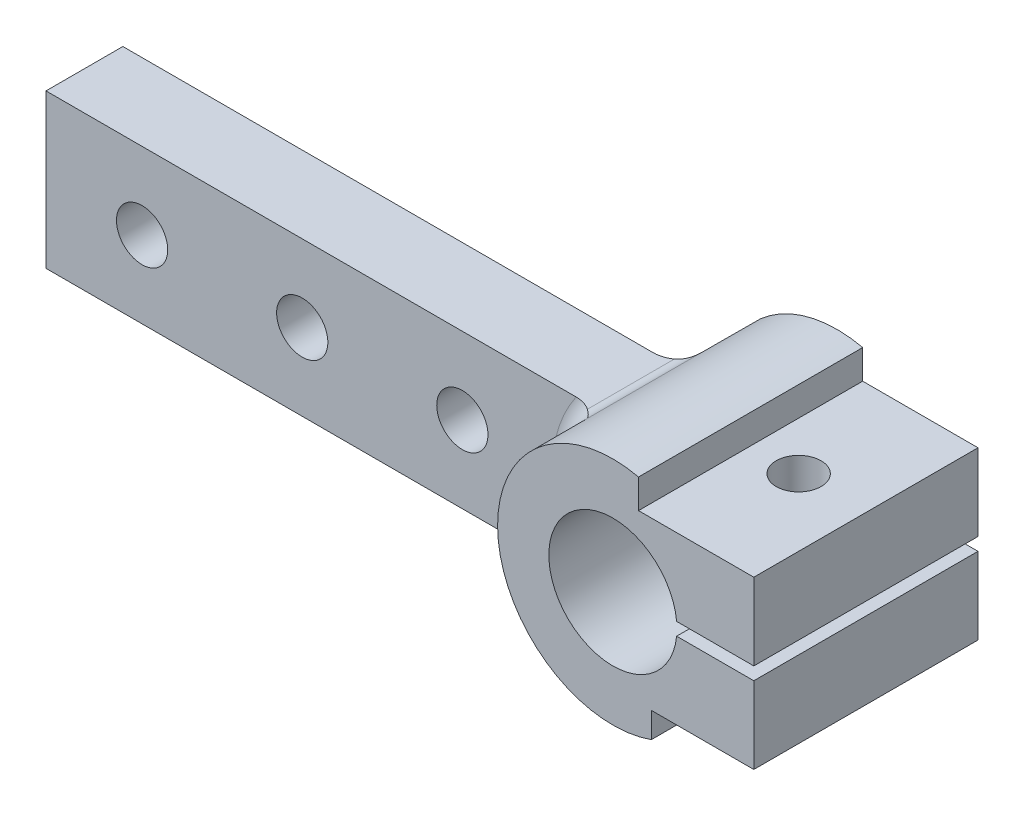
ISO-10303-21;
HEADER;
FILE_DESCRIPTION(('STEP AP214'),'2;1');
FILE_NAME('part.step','',(''),(''),'','','');
FILE_SCHEMA(('AUTOMOTIVE_DESIGN { 1 0 10303 214 1 1 1 1 }'));
ENDSEC;
DATA;
#1=APPLICATION_CONTEXT('core data for automotive mechanical design processes');
#2=APPLICATION_PROTOCOL_DEFINITION('international standard','automotive_design',2000,#1);
#3=PRODUCT_CONTEXT('',#1,'mechanical');
#4=PRODUCT('Part','Part','',(#3));
#5=PRODUCT_RELATED_PRODUCT_CATEGORY('part','',(#4));
#6=PRODUCT_DEFINITION_FORMATION('','',#4);
#7=PRODUCT_DEFINITION_CONTEXT('part definition',#1,'design');
#8=PRODUCT_DEFINITION('design','',#6,#7);
#9=PRODUCT_DEFINITION_SHAPE('','',#8);
#10=(LENGTH_UNIT() NAMED_UNIT(*) SI_UNIT(.MILLI.,.METRE.));
#11=(NAMED_UNIT(*) PLANE_ANGLE_UNIT() SI_UNIT($,.RADIAN.));
#12=(NAMED_UNIT(*) SI_UNIT($,.STERADIAN.) SOLID_ANGLE_UNIT());
#13=UNCERTAINTY_MEASURE_WITH_UNIT(LENGTH_MEASURE(1.E-05),#10,'distance_accuracy_value','');
#14=(GEOMETRIC_REPRESENTATION_CONTEXT(3) GLOBAL_UNCERTAINTY_ASSIGNED_CONTEXT((#13)) GLOBAL_UNIT_ASSIGNED_CONTEXT((#10,
#11,#12)) REPRESENTATION_CONTEXT('',''));
#15=CARTESIAN_POINT('',(0.,0.,0.));
#16=DIRECTION('',(0.,0.,1.));
#17=DIRECTION('',(1.,0.,0.));
#18=AXIS2_PLACEMENT_3D('',#15,#16,#17);
#19=CARTESIAN_POINT('',(22.,14.,17.5));
#20=DIRECTION('',(-1.,0.,0.));
#21=DIRECTION('',(0.,0.,1.));
#22=AXIS2_PLACEMENT_3D('',#19,#20,#21);
#23=PLANE('',#22);
#24=DIRECTION('',(0.,1.,0.));
#25=VECTOR('',#24,1.);
#26=CARTESIAN_POINT('',(22.,14.,17.5));
#27=LINE('',#26,#25);
#28=CARTESIAN_POINT('',(22.,0.999999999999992,17.5));
#29=VERTEX_POINT('',#28);
#30=CARTESIAN_POINT('',(22.,13.,17.5));
#31=VERTEX_POINT('',#30);
#32=EDGE_CURVE('E196',#29,#31,#27,.T.);
#33=ORIENTED_EDGE('',*,*,#32,.F.);
#34=DIRECTION('',(0.,0.,-1.));
#35=VECTOR('',#34,1.);
#36=CARTESIAN_POINT('',(22.,0.999999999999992,17.5));
#37=LINE('',#36,#35);
#38=CARTESIAN_POINT('',(22.,0.999999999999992,-17.5));
#39=VERTEX_POINT('',#38);
#40=EDGE_CURVE('E177',#29,#39,#37,.T.);
#41=ORIENTED_EDGE('',*,*,#40,.T.);
#42=DIRECTION('',(0.,1.,0.));
#43=VECTOR('',#42,1.);
#44=CARTESIAN_POINT('',(22.,14.,-17.5));
#45=LINE('',#44,#43);
#46=CARTESIAN_POINT('',(22.,13.,-17.5));
#47=VERTEX_POINT('',#46);
#48=EDGE_CURVE('E197',#39,#47,#45,.T.);
#49=ORIENTED_EDGE('',*,*,#48,.T.);
#50=DIRECTION('',(0.,0.,-1.));
#51=VECTOR('',#50,1.);
#52=CARTESIAN_POINT('',(22.,13.,17.5));
#53=LINE('',#52,#51);
#54=EDGE_CURVE('E342',#31,#47,#53,.T.);
#55=ORIENTED_EDGE('',*,*,#54,.F.);
#56=EDGE_LOOP('',(#33,#41,#49,#55));
#57=FACE_BOUND('',#56,.T.);
#58=ADVANCED_FACE('F30',(#57),#23,.F.);
#59=CARTESIAN_POINT('',(11.5,-18.,0.));
#60=DIRECTION('',(0.,1.,0.));
#61=DIRECTION('',(0.,0.,1.));
#62=AXIS2_PLACEMENT_3D('',#59,#60,#61);
#63=CYLINDRICAL_SURFACE('',#62,3.5);
#64=CARTESIAN_POINT('',(11.5,13.,0.));
#65=DIRECTION('',(0.,-1.,0.));
#66=DIRECTION('',(0.,0.,-1.));
#67=AXIS2_PLACEMENT_3D('',#64,#65,#66);
#68=CIRCLE('',#67,3.5);
#69=CARTESIAN_POINT('',(11.5,13.,-3.5));
#70=VERTEX_POINT('',#69);
#71=EDGE_CURVE('E221',#70,#70,#68,.F.);
#72=ORIENTED_EDGE('',*,*,#71,.T.);
#73=EDGE_LOOP('',(#72));
#74=FACE_BOUND('',#73,.T.);
#75=CARTESIAN_POINT('',(8.,-6.,0.));
#76=CARTESIAN_POINT('',(8.00000040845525,-5.99999966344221,0.0670353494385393));
#77=CARTESIAN_POINT('',(8.00193129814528,-5.99742758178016,0.134096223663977));
#78=CARTESIAN_POINT('',(8.00960622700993,-5.98717362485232,0.26764031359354));
#79=CARTESIAN_POINT('',(8.01535312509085,-5.9794879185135,0.334123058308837));
#80=CARTESIAN_POINT('',(8.03053092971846,-5.95908841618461,0.466046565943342));
#81=CARTESIAN_POINT('',(8.0399701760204,-5.94636323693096,0.531484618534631));
#82=CARTESIAN_POINT('',(8.06228834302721,-5.91606782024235,0.660640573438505));
#83=CARTESIAN_POINT('',(8.07516895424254,-5.89849520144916,0.72435761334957));
#84=CARTESIAN_POINT('',(8.11832200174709,-5.8391130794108,0.911302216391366));
#85=CARTESIAN_POINT('',(8.15323440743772,-5.79047169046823,1.0313783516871));
#86=CARTESIAN_POINT('',(8.23245744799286,-5.67727012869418,1.260111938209));
#87=CARTESIAN_POINT('',(8.27676667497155,-5.61271234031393,1.36877109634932));
#88=CARTESIAN_POINT('',(8.38709910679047,-5.44695787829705,1.60691939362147));
#89=CARTESIAN_POINT('',(8.4555062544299,-5.34066720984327,1.73175098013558));
#90=CARTESIAN_POINT('',(8.59705502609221,-5.10969899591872,1.95985748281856));
#91=CARTESIAN_POINT('',(8.67020537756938,-4.98498698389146,2.06309109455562));
#92=CARTESIAN_POINT('',(8.79705902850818,-4.75648089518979,2.22524501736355));
#93=CARTESIAN_POINT('',(8.85080853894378,-4.65583185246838,2.2886746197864));
#94=CARTESIAN_POINT('',(8.95687980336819,-4.44835596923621,2.40599253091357));
#95=CARTESIAN_POINT('',(9.0092008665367,-4.34152621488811,2.45987628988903));
#96=CARTESIAN_POINT('',(9.11141414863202,-4.12271099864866,2.55924735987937));
#97=CARTESIAN_POINT('',(9.16130234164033,-4.0107175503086,2.60472107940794));
#98=CARTESIAN_POINT('',(9.25781641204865,-3.78261706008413,2.68824850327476));
#99=CARTESIAN_POINT('',(9.30444120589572,-3.6665086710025,2.72629975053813));
#100=CARTESIAN_POINT('',(9.41940438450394,-3.36362254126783,2.81586397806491));
#101=CARTESIAN_POINT('',(9.48492984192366,-3.17436793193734,2.862648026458));
#102=CARTESIAN_POINT('',(9.60509450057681,-2.78977246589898,2.94356333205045));
#103=CARTESIAN_POINT('',(9.65972756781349,-2.59442825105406,2.97768746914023));
#104=CARTESIAN_POINT('',(9.75730686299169,-2.19918979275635,3.03582712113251));
#105=CARTESIAN_POINT('',(9.80024193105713,-1.99929140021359,3.0598329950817));
#106=CARTESIAN_POINT('',(9.87386007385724,-1.5964992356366,3.09958276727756));
#107=CARTESIAN_POINT('',(9.90454516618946,-1.39360596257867,3.11532802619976));
#108=CARTESIAN_POINT('',(9.95455471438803,-0.976256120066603,3.14044917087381));
#109=CARTESIAN_POINT('',(9.97327270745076,-0.761706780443,3.14948830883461));
#110=CARTESIAN_POINT('',(9.99681882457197,-0.33165693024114,3.16079335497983));
#111=CARTESIAN_POINT('',(10.0016456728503,-0.116156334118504,3.16305864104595));
#112=CARTESIAN_POINT('',(9.99736887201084,0.314694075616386,3.16102914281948));
#113=CARTESIAN_POINT('',(9.98826406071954,0.530043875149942,3.15673381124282));
#114=CARTESIAN_POINT('',(9.9561945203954,0.959443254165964,3.14117589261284));
#115=CARTESIAN_POINT('',(9.93323132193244,1.17349297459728,3.12991407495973));
#116=CARTESIAN_POINT('',(9.87598441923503,1.58245582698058,3.10056773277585));
#117=CARTESIAN_POINT('',(9.84272703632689,1.7775558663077,3.08308597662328));
#118=CARTESIAN_POINT('',(9.76490281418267,2.16463282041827,3.03997083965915));
#119=CARTESIAN_POINT('',(9.720334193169,2.35660923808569,3.01433617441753));
#120=CARTESIAN_POINT('',(9.62048325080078,2.7358146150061,2.95310741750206));
#121=CARTESIAN_POINT('',(9.56521872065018,2.92305088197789,2.91752982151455));
#122=CARTESIAN_POINT('',(9.44477909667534,3.2914469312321,2.83398150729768));
#123=CARTESIAN_POINT('',(9.37960995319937,3.4726102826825,2.78601821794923));
#124=CARTESIAN_POINT('',(9.26948946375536,3.75353804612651,2.69768909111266));
#125=CARTESIAN_POINT('',(9.22731510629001,3.85599682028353,2.66237713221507));
#126=CARTESIAN_POINT('',(9.14048017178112,4.05754199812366,2.58573485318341));
#127=CARTESIAN_POINT('',(9.09582027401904,4.15662931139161,2.54440617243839));
#128=CARTESIAN_POINT('',(9.00459513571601,4.3507182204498,2.45500087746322));
#129=CARTESIAN_POINT('',(8.95803143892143,4.44572300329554,2.40692965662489));
#130=CARTESIAN_POINT('',(8.86373041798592,4.63088452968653,2.30325608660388));
#131=CARTESIAN_POINT('',(8.81599340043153,4.72104252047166,2.24765568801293));
#132=CARTESIAN_POINT('',(8.69524511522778,4.94121163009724,2.09689431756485));
#133=CARTESIAN_POINT('',(8.62204770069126,5.06746071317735,1.99623252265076));
#134=CARTESIAN_POINT('',(8.47972871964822,5.30217010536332,1.77351001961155));
#135=CARTESIAN_POINT('',(8.41060108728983,5.41065734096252,1.65148229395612));
#136=CARTESIAN_POINT('',(8.2967789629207,5.58316268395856,1.41511365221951));
#137=CARTESIAN_POINT('',(8.25006597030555,5.65170697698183,1.30507113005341));
#138=CARTESIAN_POINT('',(8.16619675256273,5.77222921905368,1.07282783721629));
#139=CARTESIAN_POINT('',(8.12903635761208,5.82421439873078,0.950632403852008));
#140=CARTESIAN_POINT('',(8.06731930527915,5.90941521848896,0.69570422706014));
#141=CARTESIAN_POINT('',(8.04285676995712,5.94249087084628,0.562900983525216));
#142=CARTESIAN_POINT('',(8.0095235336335,5.98734930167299,0.291839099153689));
#143=CARTESIAN_POINT('',(8.00064327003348,5.9991451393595,0.153583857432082));
#144=CARTESIAN_POINT('',(7.99949663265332,6.00066866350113,-0.10642656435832));
#145=CARTESIAN_POINT('',(8.00536277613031,5.99287691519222,-0.228168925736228));
#146=CARTESIAN_POINT('',(8.02935737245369,5.96068948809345,-0.468161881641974));
#147=CARTESIAN_POINT('',(8.04748400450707,5.93629627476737,-0.586412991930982));
#148=CARTESIAN_POINT('',(8.09418334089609,5.87245371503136,-0.81475623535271));
#149=CARTESIAN_POINT('',(8.12261175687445,5.83321201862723,-0.924936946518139));
#150=CARTESIAN_POINT('',(8.18789409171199,5.74121664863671,-1.13677787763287));
#151=CARTESIAN_POINT('',(8.22475115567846,5.68845793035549,-1.2384348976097));
#152=CARTESIAN_POINT('',(8.32019589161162,5.54833215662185,-1.46969053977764));
#153=CARTESIAN_POINT('',(8.38166053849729,5.45548501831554,-1.59478309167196));
#154=CARTESIAN_POINT('',(8.51083986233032,5.25168221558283,-1.82551645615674));
#155=CARTESIAN_POINT('',(8.57856645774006,5.14069169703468,-1.93111897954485));
#156=CARTESIAN_POINT('',(8.69622003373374,4.93815684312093,-2.09666608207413));
#157=CARTESIAN_POINT('',(8.74577558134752,4.84996574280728,-2.16108483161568));
#158=CARTESIAN_POINT('',(8.84445361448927,4.66758839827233,-2.28125462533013));
#159=CARTESIAN_POINT('',(8.89357590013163,4.57339953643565,-2.33700184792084));
#160=CARTESIAN_POINT('',(8.99041049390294,4.37998142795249,-2.44069684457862));
#161=CARTESIAN_POINT('',(9.03812089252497,4.28074580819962,-2.48863441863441));
#162=CARTESIAN_POINT('',(9.13132181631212,4.07816271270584,-2.57749983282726));
#163=CARTESIAN_POINT('',(9.17681159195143,3.97481386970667,-2.61842531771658));
#164=CARTESIAN_POINT('',(9.29043254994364,3.70406474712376,-2.71592290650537));
#165=CARTESIAN_POINT('',(9.35647870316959,3.53412248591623,-2.7678933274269));
#166=CARTESIAN_POINT('',(9.48004726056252,3.18787793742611,-2.85931592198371));
#167=CARTESIAN_POINT('',(9.53756487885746,3.0115721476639,-2.89876108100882));
#168=CARTESIAN_POINT('',(9.64321165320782,2.65392092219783,-2.96754372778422));
#169=CARTESIAN_POINT('',(9.69132429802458,2.47256725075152,-2.99686350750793));
#170=CARTESIAN_POINT('',(9.77744918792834,2.10639103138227,-3.04717812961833));
#171=CARTESIAN_POINT('',(9.8154621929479,1.92156874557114,-3.06817359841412));
#172=CARTESIAN_POINT('',(9.89144868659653,1.49035797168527,-3.10885807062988));
#173=CARTESIAN_POINT('',(9.92558098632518,1.24304582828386,-3.12601779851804));
#174=CARTESIAN_POINT('',(9.97526218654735,0.746034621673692,-3.15054391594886));
#175=CARTESIAN_POINT('',(9.99080484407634,0.496334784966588,-3.1579070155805));
#176=CARTESIAN_POINT('',(10.0031270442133,-0.00370140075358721,-3.16376637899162));
#177=CARTESIAN_POINT('',(9.99990114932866,-0.254037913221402,-3.162260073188));
#178=CARTESIAN_POINT('',(9.97470460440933,-0.753496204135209,-3.15018712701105));
#179=CARTESIAN_POINT('',(9.95273931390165,-1.00261830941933,-3.13962307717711));
#180=CARTESIAN_POINT('',(9.89608469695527,-1.4522321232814,-3.11098818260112));
#181=CARTESIAN_POINT('',(9.86448439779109,-1.65322895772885,-3.09465851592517));
#182=CARTESIAN_POINT('',(9.78927006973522,-2.05216377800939,-3.05372670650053));
#183=CARTESIAN_POINT('',(9.74565471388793,-2.2501014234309,-3.0291236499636));
#184=CARTESIAN_POINT('',(9.6470240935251,-2.64111609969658,-2.96981240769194));
#185=CARTESIAN_POINT('',(9.5920345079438,-2.83420299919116,-2.93512691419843));
#186=CARTESIAN_POINT('',(9.47144196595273,-3.21425670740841,-2.85311828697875));
#187=CARTESIAN_POINT('',(9.40584543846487,-3.40122714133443,-2.80580279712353));
#188=CARTESIAN_POINT('',(9.29511243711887,-3.68967886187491,-2.71866003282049));
#189=CARTESIAN_POINT('',(9.25302365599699,-3.79393982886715,-2.68409899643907));
#190=CARTESIAN_POINT('',(9.16620641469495,-3.99913168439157,-2.60896692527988));
#191=CARTESIAN_POINT('',(9.1214786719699,-4.10006346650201,-2.56839751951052));
#192=CARTESIAN_POINT('',(9.02994606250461,-4.2978993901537,-2.48049522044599));
#193=CARTESIAN_POINT('',(8.98314255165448,-4.3948060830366,-2.43316669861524));
#194=CARTESIAN_POINT('',(8.88818544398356,-4.58381495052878,-2.33094113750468));
#195=CARTESIAN_POINT('',(8.8400321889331,-4.67591832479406,-2.27604600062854));
#196=CARTESIAN_POINT('',(8.71771009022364,-4.90158053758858,-2.12662133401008));
#197=CARTESIAN_POINT('',(8.64322827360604,-5.03135338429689,-2.02646791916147));
#198=CARTESIAN_POINT('',(8.49795887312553,-5.27300022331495,-1.80423857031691));
#199=CARTESIAN_POINT('',(8.42716555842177,-5.38490257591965,-1.68219803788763));
#200=CARTESIAN_POINT('',(8.31058608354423,-5.56262572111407,-1.44596350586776));
#201=CARTESIAN_POINT('',(8.2627773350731,-5.63313670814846,-1.33631756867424));
#202=CARTESIAN_POINT('',(8.17654590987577,-5.75758983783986,-1.10448569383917));
#203=CARTESIAN_POINT('',(8.13811919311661,-5.81153911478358,-0.982305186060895));
#204=CARTESIAN_POINT('',(8.07786802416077,-5.89494608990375,-0.743212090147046));
#205=CARTESIAN_POINT('',(8.05460897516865,-5.92655913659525,-0.627412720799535));
#206=CARTESIAN_POINT('',(8.01987098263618,-5.97348682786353,-0.391003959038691));
#207=CARTESIAN_POINT('',(8.00836088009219,-5.98884458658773,-0.270408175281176));
#208=CARTESIAN_POINT('',(8.00212267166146,-5.99716849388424,-0.124420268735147));
#209=CARTESIAN_POINT('',(8.00132751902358,-5.99822952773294,-0.0995587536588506));
#210=CARTESIAN_POINT('',(8.00026607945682,-5.99964538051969,-0.049799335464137));
#211=CARTESIAN_POINT('',(7.9999998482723,-6.00000012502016,-0.0249014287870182));
#212=CARTESIAN_POINT('',(8.,-6.,0.));
#213=B_SPLINE_CURVE_WITH_KNOTS('',3,(#75,#76,#77,#78,#79,#80,#81,#82,#83,#84,#85,#86,#87,#88,
#89,#90,#91,#92,#93,#94,#95,#96,#97,#98,#99,#100,#101,#102,#103,#104,#105,#106,#107,#108,#109,
#110,#111,#112,#113,#114,#115,#116,#117,#118,#119,#120,#121,#122,#123,#124,#125,#126,#127,#128,
#129,#130,#131,#132,#133,#134,#135,#136,#137,#138,#139,#140,#141,#142,#143,#144,#145,#146,#147,
#148,#149,#150,#151,#152,#153,#154,#155,#156,#157,#158,#159,#160,#161,#162,#163,#164,#165,#166,
#167,#168,#169,#170,#171,#172,#173,#174,#175,#176,#177,#178,#179,#180,#181,#182,#183,#184,#185,
#186,#187,#188,#189,#190,#191,#192,#193,#194,#195,#196,#197,#198,#199,#200,#201,#202,#203,#204,
#205,#206,#207,#208,#209,#210,#211,#212),.UNSPECIFIED.,.T.,.F.,(4,2,2,2,2,2,2,2,2,2,2,2,2,2,2,2,
2,2,2,2,2,2,2,2,2,2,2,2,2,2,2,2,2,2,2,2,2,2,2,2,2,2,2,2,2,2,2,2,2,2,2,2,2,2,2,2,2,2,2,2,2,2,2,2,
2,2,2,2,4),(0.,0.201073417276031,0.402297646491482,0.603979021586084,0.805759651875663,
1.20613950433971,1.60645941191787,2.13648186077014,2.66750885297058,3.05863542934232,
3.44994792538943,3.84188739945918,4.23395639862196,4.85001851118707,5.46642658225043,
6.08342066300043,6.70031308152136,7.34640411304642,7.99255448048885,8.6387587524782,
9.28489166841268,9.88046959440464,10.476141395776,11.0708307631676,11.6651642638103,
12.0138418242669,12.3624245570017,12.7107300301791,13.0589454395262,13.5889213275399,
14.1180861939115,14.5298806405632,14.9414950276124,15.3561184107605,15.7704872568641,
16.1350834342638,16.4996254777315,16.8592474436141,17.2190038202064,17.7186527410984,
18.2192730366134,18.5785949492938,18.9380747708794,19.2980204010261,19.6580866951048,
20.2259625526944,20.7941558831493,21.3633379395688,21.9324771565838,22.6822402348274,
23.4322550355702,24.182487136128,24.9325047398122,25.5443696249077,26.1563021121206,
26.7668678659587,27.3770649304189,27.7297563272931,28.0823522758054,28.4347212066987,
28.7870017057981,29.3252707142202,29.8626768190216,30.2776339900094,30.692412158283,
31.0576595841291,31.4219358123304,31.4966201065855,31.5713122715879),.UNSPECIFIED.);
#214=CARTESIAN_POINT('',(9.9498743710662,1.,3.13801060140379));
#215=VERTEX_POINT('',#214);
#216=CARTESIAN_POINT('',(9.9498743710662,0.999999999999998,-3.13801060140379));
#217=VERTEX_POINT('',#216);
#218=EDGE_CURVE('E219',#215,#217,#213,.T.);
#219=ORIENTED_EDGE('',*,*,#218,.T.);
#220=CARTESIAN_POINT('',(11.5,0.999999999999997,0.));
#221=DIRECTION('',(0.,1.,0.));
#222=DIRECTION('',(-1.,0.,0.));
#223=AXIS2_PLACEMENT_3D('',#220,#221,#222);
#224=CIRCLE('',#223,3.5);
#225=EDGE_CURVE('E310',#217,#215,#224,.F.);
#226=ORIENTED_EDGE('',*,*,#225,.T.);
#227=EDGE_LOOP('',(#219,#226));
#228=FACE_BOUND('',#227,.T.);
#229=ADVANCED_FACE('F422',(#74,#228),#63,.F.);
#230=CARTESIAN_POINT('',(0.,0.,17.5));
#231=DIRECTION('',(0.,0.,-1.));
#232=DIRECTION('',(-1.,0.,0.));
#233=AXIS2_PLACEMENT_3D('',#230,#231,#232);
#234=CYLINDRICAL_SURFACE('',#233,18.);
#235=CARTESIAN_POINT('',(0.,0.,9.));
#236=DIRECTION('',(0.,0.,-1.));
#237=DIRECTION('',(-1.,0.,0.));
#238=AXIS2_PLACEMENT_3D('',#235,#236,#237);
#239=CIRCLE('',#238,18.);
#240=CARTESIAN_POINT('',(-12.5973758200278,12.8571428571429,9.));
#241=VERTEX_POINT('',#240);
#242=CARTESIAN_POINT('',(-12.5973758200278,-12.8571428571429,9.));
#243=VERTEX_POINT('',#242);
#244=EDGE_CURVE('E480',#241,#243,#239,.F.);
#245=ORIENTED_EDGE('',*,*,#244,.T.);
#246=DIRECTION('',(0.,0.,-1.));
#247=VECTOR('',#246,1.);
#248=CARTESIAN_POINT('',(-12.5973758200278,-12.8571428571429,17.5));
#249=LINE('',#248,#247);
#250=CARTESIAN_POINT('',(-12.5973758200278,-12.8571428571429,-9.));
#251=VERTEX_POINT('',#250);
#252=EDGE_CURVE('E482',#243,#251,#249,.T.);
#253=ORIENTED_EDGE('',*,*,#252,.T.);
#254=CARTESIAN_POINT('',(0.,0.,-9.));
#255=DIRECTION('',(0.,0.,-1.));
#256=DIRECTION('',(-1.,0.,0.));
#257=AXIS2_PLACEMENT_3D('',#254,#255,#256);
#258=CIRCLE('',#257,18.);
#259=CARTESIAN_POINT('',(-12.5973758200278,12.8571428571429,-9.));
#260=VERTEX_POINT('',#259);
#261=EDGE_CURVE('E385',#251,#260,#258,.T.);
#262=ORIENTED_EDGE('',*,*,#261,.T.);
#263=DIRECTION('',(0.,0.,-1.));
#264=VECTOR('',#263,1.);
#265=CARTESIAN_POINT('',(-12.5973758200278,12.8571428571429,17.5));
#266=LINE('',#265,#264);
#267=EDGE_CURVE('E478',#260,#241,#266,.F.);
#268=ORIENTED_EDGE('',*,*,#267,.T.);
#269=EDGE_LOOP('',(#245,#253,#262,#268));
#270=FACE_BOUND('',#269,.T.);
#271=CARTESIAN_POINT('',(0.,0.,-17.5));
#272=DIRECTION('',(0.,0.,1.));
#273=DIRECTION('',(1.,0.,0.));
#274=AXIS2_PLACEMENT_3D('',#271,#272,#273);
#275=CIRCLE('',#274,18.);
#276=CARTESIAN_POINT('',(4.,17.5499287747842,-17.5));
#277=VERTEX_POINT('',#276);
#278=CARTESIAN_POINT('',(5.99999999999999,-16.9705627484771,-17.5));
#279=VERTEX_POINT('',#278);
#280=EDGE_CURVE('E205',#277,#279,#275,.T.);
#281=ORIENTED_EDGE('',*,*,#280,.T.);
#282=DIRECTION('',(0.,0.,-1.));
#283=VECTOR('',#282,1.);
#284=CARTESIAN_POINT('',(6.,-16.9705627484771,17.5));
#285=LINE('',#284,#283);
#286=CARTESIAN_POINT('',(5.99999999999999,-16.9705627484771,17.5));
#287=VERTEX_POINT('',#286);
#288=EDGE_CURVE('E328',#279,#287,#285,.F.);
#289=ORIENTED_EDGE('',*,*,#288,.T.);
#290=CARTESIAN_POINT('',(0.,0.,17.5));
#291=DIRECTION('',(0.,0.,1.));
#292=DIRECTION('',(1.,0.,0.));
#293=AXIS2_PLACEMENT_3D('',#290,#291,#292);
#294=CIRCLE('',#293,18.);
#295=CARTESIAN_POINT('',(4.,17.5499287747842,17.5));
#296=VERTEX_POINT('',#295);
#297=EDGE_CURVE('E208',#296,#287,#294,.T.);
#298=ORIENTED_EDGE('',*,*,#297,.F.);
#299=DIRECTION('',(0.,0.,-1.));
#300=VECTOR('',#299,1.);
#301=CARTESIAN_POINT('',(4.,17.5499287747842,17.5));
#302=LINE('',#301,#300);
#303=EDGE_CURVE('E347',#296,#277,#302,.T.);
#304=ORIENTED_EDGE('',*,*,#303,.T.);
#305=EDGE_LOOP('',(#281,#289,#298,#304));
#306=FACE_BOUND('',#305,.T.);
#307=ADVANCED_FACE('F32',(#270,#306),#234,.T.);
#308=CARTESIAN_POINT('',(0.,0.,17.5));
#309=DIRECTION('',(0.,0.,1.));
#310=DIRECTION('',(1.,0.,0.));
#311=AXIS2_PLACEMENT_3D('',#308,#309,#310);
#312=PLANE('',#311);
#313=DIRECTION('',(1.,0.,0.));
#314=VECTOR('',#313,1.);
#315=CARTESIAN_POINT('',(22.,0.999999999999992,17.5));
#316=LINE('',#315,#314);
#317=CARTESIAN_POINT('',(9.9498743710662,1.,17.5));
#318=VERTEX_POINT('',#317);
#319=EDGE_CURVE('E178',#318,#29,#316,.T.);
#320=ORIENTED_EDGE('',*,*,#319,.T.);
#321=ORIENTED_EDGE('',*,*,#32,.T.);
#322=DIRECTION('',(-1.,0.,0.));
#323=VECTOR('',#322,1.);
#324=CARTESIAN_POINT('',(22.,13.,17.5));
#325=LINE('',#324,#323);
#326=CARTESIAN_POINT('',(4.,13.,17.5));
#327=VERTEX_POINT('',#326);
#328=EDGE_CURVE('E336',#31,#327,#325,.T.);
#329=ORIENTED_EDGE('',*,*,#328,.T.);
#330=DIRECTION('',(0.,1.,0.));
#331=VECTOR('',#330,1.);
#332=CARTESIAN_POINT('',(4.,13.,17.5));
#333=LINE('',#332,#331);
#334=EDGE_CURVE('E339',#327,#296,#333,.T.);
#335=ORIENTED_EDGE('',*,*,#334,.T.);
#336=ORIENTED_EDGE('',*,*,#297,.T.);
#337=DIRECTION('',(0.,1.,0.));
#338=VECTOR('',#337,1.);
#339=CARTESIAN_POINT('',(6.,-13.,17.5));
#340=LINE('',#339,#338);
#341=CARTESIAN_POINT('',(6.,-13.,17.5));
#342=VERTEX_POINT('',#341);
#343=EDGE_CURVE('E317',#287,#342,#340,.T.);
#344=ORIENTED_EDGE('',*,*,#343,.T.);
#345=DIRECTION('',(1.,0.,0.));
#346=VECTOR('',#345,1.);
#347=CARTESIAN_POINT('',(22.,-13.,17.5));
#348=LINE('',#347,#346);
#349=CARTESIAN_POINT('',(22.,-13.,17.5));
#350=VERTEX_POINT('',#349);
#351=EDGE_CURVE('E320',#342,#350,#348,.T.);
#352=ORIENTED_EDGE('',*,*,#351,.T.);
#353=CARTESIAN_POINT('',(22.,-1.00000000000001,17.5));
#354=VERTEX_POINT('',#353);
#355=EDGE_CURVE('E199',#350,#354,#27,.T.);
#356=ORIENTED_EDGE('',*,*,#355,.T.);
#357=DIRECTION('',(-1.,0.,0.));
#358=VECTOR('',#357,1.);
#359=CARTESIAN_POINT('',(22.,-1.00000000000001,17.5));
#360=LINE('',#359,#358);
#361=CARTESIAN_POINT('',(9.9498743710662,-1.00000000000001,17.5));
#362=VERTEX_POINT('',#361);
#363=EDGE_CURVE('E172',#354,#362,#360,.T.);
#364=ORIENTED_EDGE('',*,*,#363,.T.);
#365=CARTESIAN_POINT('',(0.,0.,17.5));
#366=DIRECTION('',(0.,0.,-1.));
#367=DIRECTION('',(-1.,0.,0.));
#368=AXIS2_PLACEMENT_3D('',#365,#366,#367);
#369=CIRCLE('',#368,10.);
#370=EDGE_CURVE('E220',#362,#318,#369,.T.);
#371=ORIENTED_EDGE('',*,*,#370,.T.);
#372=EDGE_LOOP('',(#320,#321,#329,#335,#336,#344,#352,#356,#364,#371));
#373=FACE_BOUND('',#372,.T.);
#374=ADVANCED_FACE('F435',(#373),#312,.T.);
#375=CARTESIAN_POINT('',(0.,0.,-17.5));
#376=DIRECTION('',(0.,0.,1.));
#377=DIRECTION('',(1.,0.,0.));
#378=AXIS2_PLACEMENT_3D('',#375,#376,#377);
#379=PLANE('',#378);
#380=ORIENTED_EDGE('',*,*,#48,.F.);
#381=DIRECTION('',(1.,0.,0.));
#382=VECTOR('',#381,1.);
#383=CARTESIAN_POINT('',(22.,0.999999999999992,-17.5));
#384=LINE('',#383,#382);
#385=CARTESIAN_POINT('',(9.9498743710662,1.,-17.5));
#386=VERTEX_POINT('',#385);
#387=EDGE_CURVE('E190',#386,#39,#384,.T.);
#388=ORIENTED_EDGE('',*,*,#387,.F.);
#389=CARTESIAN_POINT('',(0.,0.,-17.5));
#390=DIRECTION('',(0.,0.,-1.));
#391=DIRECTION('',(-1.,0.,0.));
#392=AXIS2_PLACEMENT_3D('',#389,#390,#391);
#393=CIRCLE('',#392,10.);
#394=CARTESIAN_POINT('',(9.9498743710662,-1.00000000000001,-17.5));
#395=VERTEX_POINT('',#394);
#396=EDGE_CURVE('E189',#395,#386,#393,.T.);
#397=ORIENTED_EDGE('',*,*,#396,.F.);
#398=DIRECTION('',(-1.,0.,0.));
#399=VECTOR('',#398,1.);
#400=CARTESIAN_POINT('',(22.,-1.00000000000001,-17.5));
#401=LINE('',#400,#399);
#402=CARTESIAN_POINT('',(22.,-1.00000000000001,-17.5));
#403=VERTEX_POINT('',#402);
#404=EDGE_CURVE('E169',#403,#395,#401,.T.);
#405=ORIENTED_EDGE('',*,*,#404,.F.);
#406=CARTESIAN_POINT('',(22.,-13.,-17.5));
#407=VERTEX_POINT('',#406);
#408=EDGE_CURVE('E186',#407,#403,#45,.T.);
#409=ORIENTED_EDGE('',*,*,#408,.F.);
#410=DIRECTION('',(1.,0.,0.));
#411=VECTOR('',#410,1.);
#412=CARTESIAN_POINT('',(22.,-13.,-17.5));
#413=LINE('',#412,#411);
#414=CARTESIAN_POINT('',(6.,-13.,-17.5));
#415=VERTEX_POINT('',#414);
#416=EDGE_CURVE('E315',#415,#407,#413,.T.);
#417=ORIENTED_EDGE('',*,*,#416,.F.);
#418=DIRECTION('',(0.,1.,0.));
#419=VECTOR('',#418,1.);
#420=CARTESIAN_POINT('',(6.,-13.,-17.5));
#421=LINE('',#420,#419);
#422=EDGE_CURVE('E313',#279,#415,#421,.T.);
#423=ORIENTED_EDGE('',*,*,#422,.F.);
#424=ORIENTED_EDGE('',*,*,#280,.F.);
#425=DIRECTION('',(0.,1.,0.));
#426=VECTOR('',#425,1.);
#427=CARTESIAN_POINT('',(4.,13.,-17.5));
#428=LINE('',#427,#426);
#429=CARTESIAN_POINT('',(4.,13.,-17.5));
#430=VERTEX_POINT('',#429);
#431=EDGE_CURVE('E334',#430,#277,#428,.T.);
#432=ORIENTED_EDGE('',*,*,#431,.F.);
#433=DIRECTION('',(-1.,0.,0.));
#434=VECTOR('',#433,1.);
#435=CARTESIAN_POINT('',(22.,13.,-17.5));
#436=LINE('',#435,#434);
#437=EDGE_CURVE('E331',#47,#430,#436,.T.);
#438=ORIENTED_EDGE('',*,*,#437,.F.);
#439=EDGE_LOOP('',(#380,#388,#397,#405,#409,#417,#423,#424,#432,#438));
#440=FACE_BOUND('',#439,.T.);
#441=ADVANCED_FACE('F184',(#440),#379,.F.);
#442=ORIENTED_EDGE('',*,*,#408,.T.);
#443=DIRECTION('',(0.,0.,-1.));
#444=VECTOR('',#443,1.);
#445=CARTESIAN_POINT('',(22.,-1.00000000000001,17.5));
#446=LINE('',#445,#444);
#447=EDGE_CURVE('E166',#354,#403,#446,.T.);
#448=ORIENTED_EDGE('',*,*,#447,.F.);
#449=ORIENTED_EDGE('',*,*,#355,.F.);
#450=DIRECTION('',(0.,0.,-1.));
#451=VECTOR('',#450,1.);
#452=CARTESIAN_POINT('',(22.,-13.,17.5));
#453=LINE('',#452,#451);
#454=EDGE_CURVE('E195',#350,#407,#453,.T.);
#455=ORIENTED_EDGE('',*,*,#454,.T.);
#456=EDGE_LOOP('',(#442,#448,#449,#455));
#457=FACE_BOUND('',#456,.T.);
#458=ADVANCED_FACE('F194',(#457),#23,.F.);
#459=CARTESIAN_POINT('',(11.5,-13.,0.));
#460=DIRECTION('',(0.,1.,0.));
#461=DIRECTION('',(0.,0.,1.));
#462=AXIS2_PLACEMENT_3D('',#459,#460,#461);
#463=CIRCLE('',#462,3.5);
#464=CARTESIAN_POINT('',(11.5,-13.,3.5));
#465=VERTEX_POINT('',#464);
#466=EDGE_CURVE('E325',#465,#465,#463,.F.);
#467=ORIENTED_EDGE('',*,*,#466,.T.);
#468=EDGE_LOOP('',(#467));
#469=FACE_BOUND('',#468,.T.);
#470=CARTESIAN_POINT('',(9.9498743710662,-1.00000000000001,-3.13801060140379));
#471=VERTEX_POINT('',#470);
#472=CARTESIAN_POINT('',(9.9498743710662,-1.,3.13801060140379));
#473=VERTEX_POINT('',#472);
#474=EDGE_CURVE('E212',#471,#473,#213,.T.);
#475=ORIENTED_EDGE('',*,*,#474,.T.);
#476=CARTESIAN_POINT('',(11.5,-1.,0.));
#477=DIRECTION('',(0.,-1.,0.));
#478=DIRECTION('',(0.,0.,-1.));
#479=AXIS2_PLACEMENT_3D('',#476,#477,#478);
#480=CIRCLE('',#479,3.5);
#481=EDGE_CURVE('E306',#473,#471,#480,.F.);
#482=ORIENTED_EDGE('',*,*,#481,.T.);
#483=EDGE_LOOP('',(#475,#482));
#484=FACE_BOUND('',#483,.T.);
#485=ADVANCED_FACE('F223',(#469,#484),#63,.F.);
#486=CARTESIAN_POINT('',(0.,12.,6.));
#487=DIRECTION('',(0.,-1.,0.));
#488=DIRECTION('',(1.,0.,0.));
#489=AXIS2_PLACEMENT_3D('',#486,#487,#488);
#490=PLANE('',#489);
#491=CARTESIAN_POINT('',(-17.2336879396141,12.,6.));
#492=CARTESIAN_POINT('',(-17.1045791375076,12.,6.00001648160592));
#493=CARTESIAN_POINT('',(-16.9755525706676,12.,6.00561384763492));
#494=CARTESIAN_POINT('',(-16.7184281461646,12.,6.02779901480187));
#495=CARTESIAN_POINT('',(-16.5903304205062,12.,6.04438834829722));
#496=CARTESIAN_POINT('',(-16.2153953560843,12.,6.10921533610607));
#497=CARTESIAN_POINT('',(-15.9709706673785,12.,6.17254644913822));
#498=CARTESIAN_POINT('',(-15.5516407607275,12.,6.3198532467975));
#499=CARTESIAN_POINT('',(-15.3737974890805,12.,6.39559140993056));
#500=CARTESIAN_POINT('',(-15.1143189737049,12.,6.52769577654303));
#501=CARTESIAN_POINT('',(-15.0282224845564,12.,6.57538319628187));
#502=CARTESIAN_POINT('',(-14.8596819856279,12.,6.67693578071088));
#503=CARTESIAN_POINT('',(-14.7772403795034,12.,6.73080492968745));
#504=CARTESIAN_POINT('',(-14.6969384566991,12.,6.78776801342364));
#505=B_SPLINE_CURVE_WITH_KNOTS('',3,(#491,#492,#493,#494,#495,#496,#497,#498,#499,#500,#501,
#502,#503,#504),.UNSPECIFIED.,.F.,.F.,(4,2,2,2,2,2,4),(0.,0.387049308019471,0.774152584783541,
1.52777975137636,2.10597480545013,2.40099863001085,2.69621368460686),.UNSPECIFIED.);
#506=CARTESIAN_POINT('',(-17.2336879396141,12.,6.));
#507=VERTEX_POINT('',#506);
#508=CARTESIAN_POINT('',(-14.6969384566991,12.,6.78776801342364));
#509=VERTEX_POINT('',#508);
#510=EDGE_CURVE('E409',#507,#509,#505,.T.);
#511=ORIENTED_EDGE('',*,*,#510,.T.);
#512=DIRECTION('',(0.,0.,1.));
#513=VECTOR('',#512,1.);
#514=CARTESIAN_POINT('',(-14.6969384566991,12.,-6.));
#515=LINE('',#514,#513);
#516=CARTESIAN_POINT('',(-14.6969384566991,12.,-6.78776801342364));
#517=VERTEX_POINT('',#516);
#518=EDGE_CURVE('E47',#509,#517,#515,.F.);
#519=ORIENTED_EDGE('',*,*,#518,.T.);
#520=CARTESIAN_POINT('',(-14.6969384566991,12.,-6.78776801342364));
#521=CARTESIAN_POINT('',(-14.8026595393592,12.,-6.71279199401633));
#522=CARTESIAN_POINT('',(-14.912079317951,12.,-6.6431571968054));
#523=CARTESIAN_POINT('',(-15.136946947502,12.,-6.51458719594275));
#524=CARTESIAN_POINT('',(-15.2523906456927,12.,-6.45564474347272));
#525=CARTESIAN_POINT('',(-15.4851020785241,12.,-6.34973185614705));
#526=CARTESIAN_POINT('',(-15.6022497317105,12.,-6.30249621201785));
#527=CARTESIAN_POINT('',(-15.8401123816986,12.,-6.21813655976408));
#528=CARTESIAN_POINT('',(-15.9608274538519,12.,-6.18101276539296));
#529=CARTESIAN_POINT('',(-16.2685934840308,12.,-6.10023416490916));
#530=CARTESIAN_POINT('',(-16.4574351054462,12.,-6.06325541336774));
#531=CARTESIAN_POINT('',(-16.8420478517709,12.,-6.01291275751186));
#532=CARTESIAN_POINT('',(-17.0378821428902,12.,-6.00003112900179));
#533=CARTESIAN_POINT('',(-17.2336879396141,12.,-6.));
#534=B_SPLINE_CURVE_WITH_KNOTS('',3,(#520,#521,#522,#523,#524,#525,#526,#527,#528,#529,#530,
#531,#532,#533),.UNSPECIFIED.,.F.,.F.,(4,2,2,2,2,2,4),(0.,0.388557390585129,0.776850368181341,
1.15531755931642,1.53379275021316,2.10947460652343,2.69655966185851),.UNSPECIFIED.);
#535=CARTESIAN_POINT('',(-17.2336879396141,12.,-6.));
#536=VERTEX_POINT('',#535);
#537=EDGE_CURVE('E39',#517,#536,#534,.T.);
#538=ORIENTED_EDGE('',*,*,#537,.T.);
#539=DIRECTION('',(-1.,0.,0.));
#540=VECTOR('',#539,1.);
#541=CARTESIAN_POINT('',(0.,12.,-6.));
#542=LINE('',#541,#540);
#543=CARTESIAN_POINT('',(-100.,12.,-6.));
#544=VERTEX_POINT('',#543);
#545=EDGE_CURVE('E353',#536,#544,#542,.T.);
#546=ORIENTED_EDGE('',*,*,#545,.T.);
#547=DIRECTION('',(0.,0.,-1.));
#548=VECTOR('',#547,1.);
#549=CARTESIAN_POINT('',(-100.,12.,6.));
#550=LINE('',#549,#548);
#551=CARTESIAN_POINT('',(-100.,12.,6.));
#552=VERTEX_POINT('',#551);
#553=EDGE_CURVE('E201',#552,#544,#550,.T.);
#554=ORIENTED_EDGE('',*,*,#553,.F.);
#555=DIRECTION('',(-1.,0.,0.));
#556=VECTOR('',#555,1.);
#557=CARTESIAN_POINT('',(0.,12.,6.));
#558=LINE('',#557,#556);
#559=EDGE_CURVE('E360',#507,#552,#558,.T.);
#560=ORIENTED_EDGE('',*,*,#559,.F.);
#561=EDGE_LOOP('',(#511,#519,#538,#546,#554,#560));
#562=FACE_BOUND('',#561,.T.);
#563=ADVANCED_FACE('F249',(#562),#490,.F.);
#564=CARTESIAN_POINT('',(0.,-12.,6.));
#565=DIRECTION('',(0.,1.,0.));
#566=DIRECTION('',(-1.,0.,0.));
#567=AXIS2_PLACEMENT_3D('',#564,#565,#566);
#568=PLANE('',#567);
#569=DIRECTION('',(1.,0.,0.));
#570=VECTOR('',#569,1.);
#571=CARTESIAN_POINT('',(0.,-12.,-6.));
#572=LINE('',#571,#570);
#573=CARTESIAN_POINT('',(-100.,-12.,-6.));
#574=VERTEX_POINT('',#573);
#575=CARTESIAN_POINT('',(-17.2336879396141,-12.,-6.));
#576=VERTEX_POINT('',#575);
#577=EDGE_CURVE('E357',#574,#576,#572,.T.);
#578=ORIENTED_EDGE('',*,*,#577,.T.);
#579=CARTESIAN_POINT('',(-17.2336879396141,-12.,-6.));
#580=CARTESIAN_POINT('',(-17.1045791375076,-12.,-6.00001648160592));
#581=CARTESIAN_POINT('',(-16.9755525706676,-12.,-6.00561384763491));
#582=CARTESIAN_POINT('',(-16.7184281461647,-12.,-6.02779901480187));
#583=CARTESIAN_POINT('',(-16.5903304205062,-12.,-6.04438834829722));
#584=CARTESIAN_POINT('',(-16.2153953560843,-12.,-6.10921533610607));
#585=CARTESIAN_POINT('',(-15.9709706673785,-12.,-6.17254644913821));
#586=CARTESIAN_POINT('',(-15.5516407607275,-12.,-6.3198532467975));
#587=CARTESIAN_POINT('',(-15.3737974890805,-12.,-6.39559140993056));
#588=CARTESIAN_POINT('',(-15.1143189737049,-12.,-6.52769577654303));
#589=CARTESIAN_POINT('',(-15.0282224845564,-12.,-6.57538319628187));
#590=CARTESIAN_POINT('',(-14.8596819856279,-12.,-6.67693578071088));
#591=CARTESIAN_POINT('',(-14.7772403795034,-12.,-6.73080492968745));
#592=CARTESIAN_POINT('',(-14.6969384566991,-12.,-6.78776801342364));
#593=B_SPLINE_CURVE_WITH_KNOTS('',3,(#579,#580,#581,#582,#583,#584,#585,#586,#587,#588,#589,
#590,#591,#592),.UNSPECIFIED.,.F.,.F.,(4,2,2,2,2,2,4),(0.,0.387049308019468,0.774152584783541,
1.52777975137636,2.10597480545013,2.40099863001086,2.69621368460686),.UNSPECIFIED.);
#594=CARTESIAN_POINT('',(-14.6969384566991,-12.,-6.78776801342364));
#595=VERTEX_POINT('',#594);
#596=EDGE_CURVE('E11',#576,#595,#593,.T.);
#597=ORIENTED_EDGE('',*,*,#596,.T.);
#598=DIRECTION('',(0.,0.,1.));
#599=VECTOR('',#598,1.);
#600=CARTESIAN_POINT('',(-14.6969384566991,-12.,6.));
#601=LINE('',#600,#599);
#602=CARTESIAN_POINT('',(-14.6969384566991,-12.,6.78776801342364));
#603=VERTEX_POINT('',#602);
#604=EDGE_CURVE('E475',#595,#603,#601,.T.);
#605=ORIENTED_EDGE('',*,*,#604,.T.);
#606=CARTESIAN_POINT('',(-14.6969384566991,-12.,6.78776801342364));
#607=CARTESIAN_POINT('',(-14.8026595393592,-12.,6.71279199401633));
#608=CARTESIAN_POINT('',(-14.912079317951,-12.,6.6431571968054));
#609=CARTESIAN_POINT('',(-15.136946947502,-12.,6.51458719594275));
#610=CARTESIAN_POINT('',(-15.2523906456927,-12.,6.45564474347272));
#611=CARTESIAN_POINT('',(-15.4851020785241,-12.,6.34973185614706));
#612=CARTESIAN_POINT('',(-15.6022497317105,-12.,6.30249621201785));
#613=CARTESIAN_POINT('',(-15.8401123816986,-12.,6.21813655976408));
#614=CARTESIAN_POINT('',(-15.9608274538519,-12.,6.18101276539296));
#615=CARTESIAN_POINT('',(-16.2685934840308,-12.,6.10023416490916));
#616=CARTESIAN_POINT('',(-16.4574351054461,-12.,6.06325541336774));
#617=CARTESIAN_POINT('',(-16.8420478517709,-12.,6.01291275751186));
#618=CARTESIAN_POINT('',(-17.0378821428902,-12.,6.00003112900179));
#619=CARTESIAN_POINT('',(-17.2336879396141,-12.,6.));
#620=B_SPLINE_CURVE_WITH_KNOTS('',3,(#606,#607,#608,#609,#610,#611,#612,#613,#614,#615,#616,
#617,#618,#619),.UNSPECIFIED.,.F.,.F.,(4,2,2,2,2,2,4),(0.,0.388557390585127,0.776850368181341,
1.15531755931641,1.53379275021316,2.10947460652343,2.69655966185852),.UNSPECIFIED.);
#621=CARTESIAN_POINT('',(-17.2336879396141,-12.,6.));
#622=VERTEX_POINT('',#621);
#623=EDGE_CURVE('E253',#603,#622,#620,.T.);
#624=ORIENTED_EDGE('',*,*,#623,.T.);
#625=DIRECTION('',(1.,0.,0.));
#626=VECTOR('',#625,1.);
#627=CARTESIAN_POINT('',(0.,-12.,6.));
#628=LINE('',#627,#626);
#629=CARTESIAN_POINT('',(-100.,-12.,6.));
#630=VERTEX_POINT('',#629);
#631=EDGE_CURVE('E364',#630,#622,#628,.T.);
#632=ORIENTED_EDGE('',*,*,#631,.F.);
#633=DIRECTION('',(0.,0.,-1.));
#634=VECTOR('',#633,1.);
#635=CARTESIAN_POINT('',(-100.,-12.,6.));
#636=LINE('',#635,#634);
#637=EDGE_CURVE('E366',#630,#574,#636,.T.);
#638=ORIENTED_EDGE('',*,*,#637,.T.);
#639=EDGE_LOOP('',(#578,#597,#605,#624,#632,#638));
#640=FACE_BOUND('',#639,.T.);
#641=ADVANCED_FACE('F244',(#640),#568,.F.);
#642=CARTESIAN_POINT('',(0.,12.,6.));
#643=DIRECTION('',(0.,0.,-1.));
#644=DIRECTION('',(-1.,0.,0.));
#645=AXIS2_PLACEMENT_3D('',#642,#643,#644);
#646=PLANE('',#645);
#647=CARTESIAN_POINT('',(-35.,0.,6.));
#648=DIRECTION('',(0.,0.,-1.));
#649=DIRECTION('',(-1.,0.,0.));
#650=AXIS2_PLACEMENT_3D('',#647,#648,#649);
#651=CIRCLE('',#650,3.99999999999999);
#652=CARTESIAN_POINT('',(-39.,0.,6.));
#653=VERTEX_POINT('',#652);
#654=EDGE_CURVE('E34',#653,#653,#651,.T.);
#655=ORIENTED_EDGE('',*,*,#654,.T.);
#656=EDGE_LOOP('',(#655));
#657=FACE_BOUND('',#656,.T.);
#658=CARTESIAN_POINT('',(-60.,0.,6.));
#659=DIRECTION('',(0.,0.,-1.));
#660=DIRECTION('',(-1.,0.,0.));
#661=AXIS2_PLACEMENT_3D('',#658,#659,#660);
#662=CIRCLE('',#661,3.99999999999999);
#663=CARTESIAN_POINT('',(-64.,0.,6.));
#664=VERTEX_POINT('',#663);
#665=EDGE_CURVE('E508',#664,#664,#662,.T.);
#666=ORIENTED_EDGE('',*,*,#665,.T.);
#667=EDGE_LOOP('',(#666));
#668=FACE_BOUND('',#667,.T.);
#669=CARTESIAN_POINT('',(-85.,0.,6.));
#670=DIRECTION('',(0.,0.,-1.));
#671=DIRECTION('',(-1.,0.,0.));
#672=AXIS2_PLACEMENT_3D('',#669,#670,#671);
#673=CIRCLE('',#672,3.99999999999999);
#674=CARTESIAN_POINT('',(-89.,0.,6.));
#675=VERTEX_POINT('',#674);
#676=EDGE_CURVE('E268',#675,#675,#673,.T.);
#677=ORIENTED_EDGE('',*,*,#676,.T.);
#678=EDGE_LOOP('',(#677));
#679=FACE_BOUND('',#678,.T.);
#680=ORIENTED_EDGE('',*,*,#631,.T.);
#681=CARTESIAN_POINT('',(0.,0.,6.));
#682=DIRECTION('',(0.,0.,-1.));
#683=DIRECTION('',(-1.,0.,0.));
#684=AXIS2_PLACEMENT_3D('',#681,#682,#683);
#685=CIRCLE('',#684,21.);
#686=EDGE_CURVE('E484',#622,#507,#685,.T.);
#687=ORIENTED_EDGE('',*,*,#686,.T.);
#688=ORIENTED_EDGE('',*,*,#559,.T.);
#689=DIRECTION('',(0.,-1.,0.));
#690=VECTOR('',#689,1.);
#691=CARTESIAN_POINT('',(-100.,12.,6.));
#692=LINE('',#691,#690);
#693=EDGE_CURVE('E362',#552,#630,#692,.T.);
#694=ORIENTED_EDGE('',*,*,#693,.T.);
#695=EDGE_LOOP('',(#680,#687,#688,#694));
#696=FACE_BOUND('',#695,.T.);
#697=ADVANCED_FACE('F240',(#657,#668,#679,#696),#646,.F.);
#698=CARTESIAN_POINT('',(0.,12.,-6.));
#699=DIRECTION('',(0.,0.,-1.));
#700=DIRECTION('',(-1.,0.,0.));
#701=AXIS2_PLACEMENT_3D('',#698,#699,#700);
#702=PLANE('',#701);
#703=CARTESIAN_POINT('',(-35.,0.,-6.));
#704=DIRECTION('',(0.,0.,-1.));
#705=DIRECTION('',(-1.,0.,0.));
#706=AXIS2_PLACEMENT_3D('',#703,#704,#705);
#707=CIRCLE('',#706,3.99999999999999);
#708=CARTESIAN_POINT('',(-39.,0.,-6.));
#709=VERTEX_POINT('',#708);
#710=EDGE_CURVE('E516',#709,#709,#707,.T.);
#711=ORIENTED_EDGE('',*,*,#710,.F.);
#712=EDGE_LOOP('',(#711));
#713=FACE_BOUND('',#712,.T.);
#714=CARTESIAN_POINT('',(-60.,0.,-6.));
#715=DIRECTION('',(0.,0.,-1.));
#716=DIRECTION('',(-1.,0.,0.));
#717=AXIS2_PLACEMENT_3D('',#714,#715,#716);
#718=CIRCLE('',#717,3.99999999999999);
#719=CARTESIAN_POINT('',(-64.,0.,-6.));
#720=VERTEX_POINT('',#719);
#721=EDGE_CURVE('E510',#720,#720,#718,.T.);
#722=ORIENTED_EDGE('',*,*,#721,.F.);
#723=EDGE_LOOP('',(#722));
#724=FACE_BOUND('',#723,.T.);
#725=CARTESIAN_POINT('',(-85.,0.,-6.));
#726=DIRECTION('',(0.,0.,-1.));
#727=DIRECTION('',(-1.,0.,0.));
#728=AXIS2_PLACEMENT_3D('',#725,#726,#727);
#729=CIRCLE('',#728,3.99999999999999);
#730=CARTESIAN_POINT('',(-89.,0.,-6.));
#731=VERTEX_POINT('',#730);
#732=EDGE_CURVE('E394',#731,#731,#729,.T.);
#733=ORIENTED_EDGE('',*,*,#732,.F.);
#734=EDGE_LOOP('',(#733));
#735=FACE_BOUND('',#734,.T.);
#736=ORIENTED_EDGE('',*,*,#545,.F.);
#737=CARTESIAN_POINT('',(0.,0.,-6.));
#738=DIRECTION('',(0.,0.,-1.));
#739=DIRECTION('',(-1.,0.,0.));
#740=AXIS2_PLACEMENT_3D('',#737,#738,#739);
#741=CIRCLE('',#740,21.);
#742=EDGE_CURVE('E380',#536,#576,#741,.F.);
#743=ORIENTED_EDGE('',*,*,#742,.T.);
#744=ORIENTED_EDGE('',*,*,#577,.F.);
#745=DIRECTION('',(0.,-1.,0.));
#746=VECTOR('',#745,1.);
#747=CARTESIAN_POINT('',(-100.,12.,-6.));
#748=LINE('',#747,#746);
#749=EDGE_CURVE('E355',#544,#574,#748,.T.);
#750=ORIENTED_EDGE('',*,*,#749,.F.);
#751=EDGE_LOOP('',(#736,#743,#744,#750));
#752=FACE_BOUND('',#751,.T.);
#753=ADVANCED_FACE('F237',(#713,#724,#735,#752),#702,.T.);
#754=CARTESIAN_POINT('',(-100.,12.,6.));
#755=DIRECTION('',(1.,0.,0.));
#756=DIRECTION('',(0.,0.,-1.));
#757=AXIS2_PLACEMENT_3D('',#754,#755,#756);
#758=PLANE('',#757);
#759=ORIENTED_EDGE('',*,*,#749,.T.);
#760=ORIENTED_EDGE('',*,*,#637,.F.);
#761=ORIENTED_EDGE('',*,*,#693,.F.);
#762=ORIENTED_EDGE('',*,*,#553,.T.);
#763=EDGE_LOOP('',(#759,#760,#761,#762));
#764=FACE_BOUND('',#763,.T.);
#765=ADVANCED_FACE('F233',(#764),#758,.F.);
#766=CARTESIAN_POINT('',(0.,0.,17.5));
#767=DIRECTION('',(0.,0.,-1.));
#768=DIRECTION('',(-1.,0.,0.));
#769=AXIS2_PLACEMENT_3D('',#766,#767,#768);
#770=CYLINDRICAL_SURFACE('',#769,10.);
#771=ORIENTED_EDGE('',*,*,#396,.T.);
#772=DIRECTION('',(0.,0.,-1.));
#773=VECTOR('',#772,1.);
#774=CARTESIAN_POINT('',(9.9498743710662,1.,17.5));
#775=LINE('',#774,#773);
#776=EDGE_CURVE('E474',#386,#217,#775,.F.);
#777=ORIENTED_EDGE('',*,*,#776,.T.);
#778=ORIENTED_EDGE('',*,*,#218,.F.);
#779=EDGE_CURVE('E472',#215,#318,#775,.F.);
#780=ORIENTED_EDGE('',*,*,#779,.T.);
#781=ORIENTED_EDGE('',*,*,#370,.F.);
#782=DIRECTION('',(0.,0.,-1.));
#783=VECTOR('',#782,1.);
#784=CARTESIAN_POINT('',(9.9498743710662,-1.00000000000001,17.5));
#785=LINE('',#784,#783);
#786=EDGE_CURVE('E471',#362,#473,#785,.T.);
#787=ORIENTED_EDGE('',*,*,#786,.T.);
#788=ORIENTED_EDGE('',*,*,#474,.F.);
#789=EDGE_CURVE('E211',#471,#395,#785,.T.);
#790=ORIENTED_EDGE('',*,*,#789,.T.);
#791=EDGE_LOOP('',(#771,#777,#778,#780,#781,#787,#788,#790));
#792=FACE_BOUND('',#791,.T.);
#793=ADVANCED_FACE('F227',(#792),#770,.F.);
#794=CARTESIAN_POINT('',(4.,13.,17.5));
#795=DIRECTION('',(-1.,0.,0.));
#796=DIRECTION('',(0.,0.,1.));
#797=AXIS2_PLACEMENT_3D('',#794,#795,#796);
#798=PLANE('',#797);
#799=ORIENTED_EDGE('',*,*,#334,.F.);
#800=DIRECTION('',(0.,0.,-1.));
#801=VECTOR('',#800,1.);
#802=CARTESIAN_POINT('',(4.,13.,17.5));
#803=LINE('',#802,#801);
#804=EDGE_CURVE('E343',#327,#430,#803,.T.);
#805=ORIENTED_EDGE('',*,*,#804,.T.);
#806=ORIENTED_EDGE('',*,*,#431,.T.);
#807=ORIENTED_EDGE('',*,*,#303,.F.);
#808=EDGE_LOOP('',(#799,#805,#806,#807));
#809=FACE_BOUND('',#808,.T.);
#810=ADVANCED_FACE('F232',(#809),#798,.F.);
#811=CARTESIAN_POINT('',(22.,13.,17.5));
#812=DIRECTION('',(0.,-1.,0.));
#813=DIRECTION('',(0.,0.,-1.));
#814=AXIS2_PLACEMENT_3D('',#811,#812,#813);
#815=PLANE('',#814);
#816=ORIENTED_EDGE('',*,*,#437,.T.);
#817=ORIENTED_EDGE('',*,*,#804,.F.);
#818=ORIENTED_EDGE('',*,*,#328,.F.);
#819=ORIENTED_EDGE('',*,*,#54,.T.);
#820=EDGE_LOOP('',(#816,#817,#818,#819));
#821=FACE_BOUND('',#820,.T.);
#822=ORIENTED_EDGE('',*,*,#71,.F.);
#823=EDGE_LOOP('',(#822));
#824=FACE_BOUND('',#823,.T.);
#825=ADVANCED_FACE('F235',(#821,#824),#815,.F.);
#826=CARTESIAN_POINT('',(6.,-13.,17.5));
#827=DIRECTION('',(-1.,0.,0.));
#828=DIRECTION('',(0.,-1.,0.));
#829=AXIS2_PLACEMENT_3D('',#826,#827,#828);
#830=PLANE('',#829);
#831=ORIENTED_EDGE('',*,*,#422,.T.);
#832=DIRECTION('',(0.,0.,-1.));
#833=VECTOR('',#832,1.);
#834=CARTESIAN_POINT('',(6.,-13.,17.5));
#835=LINE('',#834,#833);
#836=EDGE_CURVE('E323',#342,#415,#835,.T.);
#837=ORIENTED_EDGE('',*,*,#836,.F.);
#838=ORIENTED_EDGE('',*,*,#343,.F.);
#839=ORIENTED_EDGE('',*,*,#288,.F.);
#840=EDGE_LOOP('',(#831,#837,#838,#839));
#841=FACE_BOUND('',#840,.T.);
#842=ADVANCED_FACE('F461',(#841),#830,.F.);
#843=CARTESIAN_POINT('',(22.,-13.,17.5));
#844=DIRECTION('',(0.,1.,0.));
#845=DIRECTION('',(0.,0.,1.));
#846=AXIS2_PLACEMENT_3D('',#843,#844,#845);
#847=PLANE('',#846);
#848=ORIENTED_EDGE('',*,*,#416,.T.);
#849=ORIENTED_EDGE('',*,*,#454,.F.);
#850=ORIENTED_EDGE('',*,*,#351,.F.);
#851=ORIENTED_EDGE('',*,*,#836,.T.);
#852=EDGE_LOOP('',(#848,#849,#850,#851));
#853=FACE_BOUND('',#852,.T.);
#854=ORIENTED_EDGE('',*,*,#466,.F.);
#855=EDGE_LOOP('',(#854));
#856=FACE_BOUND('',#855,.T.);
#857=ADVANCED_FACE('F463',(#853,#856),#847,.F.);
#858=CARTESIAN_POINT('',(22.,-1.00000000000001,17.5));
#859=DIRECTION('',(0.,-1.,0.));
#860=DIRECTION('',(0.,0.,-1.));
#861=AXIS2_PLACEMENT_3D('',#858,#859,#860);
#862=PLANE('',#861);
#863=ORIENTED_EDGE('',*,*,#363,.F.);
#864=ORIENTED_EDGE('',*,*,#447,.T.);
#865=ORIENTED_EDGE('',*,*,#404,.T.);
#866=ORIENTED_EDGE('',*,*,#789,.F.);
#867=ORIENTED_EDGE('',*,*,#481,.F.);
#868=ORIENTED_EDGE('',*,*,#786,.F.);
#869=EDGE_LOOP('',(#863,#864,#865,#866,#867,#868));
#870=FACE_BOUND('',#869,.T.);
#871=ADVANCED_FACE('F168',(#870),#862,.F.);
#872=CARTESIAN_POINT('',(22.,0.999999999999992,17.5));
#873=DIRECTION('',(0.,1.,0.));
#874=DIRECTION('',(-1.,0.,0.));
#875=AXIS2_PLACEMENT_3D('',#872,#873,#874);
#876=PLANE('',#875);
#877=ORIENTED_EDGE('',*,*,#387,.T.);
#878=ORIENTED_EDGE('',*,*,#40,.F.);
#879=ORIENTED_EDGE('',*,*,#319,.F.);
#880=ORIENTED_EDGE('',*,*,#779,.F.);
#881=ORIENTED_EDGE('',*,*,#225,.F.);
#882=ORIENTED_EDGE('',*,*,#776,.F.);
#883=EDGE_LOOP('',(#877,#878,#879,#880,#881,#882));
#884=FACE_BOUND('',#883,.T.);
#885=ADVANCED_FACE('F561',(#884),#876,.F.);
#886=CARTESIAN_POINT('',(-14.6969384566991,15.,17.5));
#887=DIRECTION('',(0.,0.,-1.));
#888=DIRECTION('',(-1.,0.,0.));
#889=AXIS2_PLACEMENT_3D('',#886,#887,#888);
#890=CYLINDRICAL_SURFACE('',#889,3.);
#891=CARTESIAN_POINT('',(-14.6969384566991,12.,6.78776801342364));
#892=CARTESIAN_POINT('',(-14.5924733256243,12.0000374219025,6.86190809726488));
#893=CARTESIAN_POINT('',(-14.490313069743,12.0054541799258,6.93905576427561));
#894=CARTESIAN_POINT('',(-14.2910107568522,12.0258961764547,7.09806405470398));
#895=CARTESIAN_POINT('',(-14.1938599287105,12.0409039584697,7.1799158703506));
#896=CARTESIAN_POINT('',(-14.0049575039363,12.0793143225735,7.34699519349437));
#897=CARTESIAN_POINT('',(-13.9131870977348,12.1026853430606,7.43220895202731));
#898=CARTESIAN_POINT('',(-13.7346520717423,12.1569878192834,7.60549400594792));
#899=CARTESIAN_POINT('',(-13.6478901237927,12.1879232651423,7.69356678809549));
#900=CARTESIAN_POINT('',(-13.4714316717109,12.2599174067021,7.8802843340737));
#901=CARTESIAN_POINT('',(-13.3822363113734,12.3016576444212,7.97913998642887));
#902=CARTESIAN_POINT('',(-13.2098789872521,12.3926725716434,8.17864218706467));
#903=CARTESIAN_POINT('',(-13.1267199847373,12.441950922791,8.27928958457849));
#904=CARTESIAN_POINT('',(-12.8864196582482,12.6002457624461,8.58281589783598));
#905=CARTESIAN_POINT('',(-12.7382066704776,12.719826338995,8.7875452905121));
#906=CARTESIAN_POINT('',(-12.6009217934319,12.8536728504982,8.99464114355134));
#907=CARTESIAN_POINT('',(-12.5991477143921,12.855406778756,8.9973206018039));
#908=CARTESIAN_POINT('',(-12.5973758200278,12.8571428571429,9.));
#909=B_SPLINE_CURVE_WITH_KNOTS('',3,(#891,#892,#893,#894,#895,#896,#897,#898,#899,#900,#901,
#902,#903,#904,#905,#906,#907,#908),.UNSPECIFIED.,.F.,.F.,(4,2,2,2,2,2,2,2,4),(0.,
0.383933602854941,0.767170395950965,1.14897590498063,1.53098324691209,1.9491937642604,
2.36760807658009,3.20330860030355,3.2142630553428),.UNSPECIFIED.);
#910=EDGE_CURVE('E296',#241,#509,#909,.F.);
#911=ORIENTED_EDGE('',*,*,#910,.F.);
#912=ORIENTED_EDGE('',*,*,#267,.F.);
#913=CARTESIAN_POINT('',(-14.6969384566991,12.,-6.78776801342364));
#914=CARTESIAN_POINT('',(-14.5924733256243,12.0000374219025,-6.86190809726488));
#915=CARTESIAN_POINT('',(-14.490313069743,12.0054541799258,-6.93905576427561));
#916=CARTESIAN_POINT('',(-14.2910107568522,12.0258961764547,-7.09806405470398));
#917=CARTESIAN_POINT('',(-14.1938599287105,12.0409039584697,-7.1799158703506));
#918=CARTESIAN_POINT('',(-14.0049575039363,12.0793143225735,-7.34699519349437));
#919=CARTESIAN_POINT('',(-13.9131870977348,12.1026853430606,-7.43220895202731));
#920=CARTESIAN_POINT('',(-13.7346520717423,12.1569878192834,-7.60549400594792));
#921=CARTESIAN_POINT('',(-13.6478901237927,12.1879232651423,-7.69356678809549));
#922=CARTESIAN_POINT('',(-13.4714316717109,12.2599174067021,-7.8802843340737));
#923=CARTESIAN_POINT('',(-13.3822363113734,12.3016576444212,-7.97913998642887));
#924=CARTESIAN_POINT('',(-13.2098789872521,12.3926725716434,-8.17864218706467));
#925=CARTESIAN_POINT('',(-13.1267199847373,12.441950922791,-8.27928958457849));
#926=CARTESIAN_POINT('',(-12.8864196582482,12.6002457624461,-8.58281589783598));
#927=CARTESIAN_POINT('',(-12.7382066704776,12.719826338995,-8.7875452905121));
#928=CARTESIAN_POINT('',(-12.6009217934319,12.8536728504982,-8.99464114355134));
#929=CARTESIAN_POINT('',(-12.5991477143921,12.855406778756,-8.9973206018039));
#930=CARTESIAN_POINT('',(-12.5973758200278,12.8571428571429,-9.));
#931=B_SPLINE_CURVE_WITH_KNOTS('',3,(#913,#914,#915,#916,#917,#918,#919,#920,#921,#922,#923,
#924,#925,#926,#927,#928,#929,#930),.UNSPECIFIED.,.F.,.F.,(4,2,2,2,2,2,2,2,4),(0.,
0.383933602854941,0.767170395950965,1.14897590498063,1.53098324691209,1.9491937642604,
2.36760807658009,3.20330860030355,3.2142630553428),.UNSPECIFIED.);
#932=EDGE_CURVE('E191',#517,#260,#931,.T.);
#933=ORIENTED_EDGE('',*,*,#932,.F.);
#934=ORIENTED_EDGE('',*,*,#518,.F.);
#935=EDGE_LOOP('',(#911,#912,#933,#934));
#936=FACE_BOUND('',#935,.T.);
#937=ADVANCED_FACE('F275',(#936),#890,.F.);
#938=CARTESIAN_POINT('',(0.,0.,-9.));
#939=DIRECTION('',(0.,0.,-1.));
#940=DIRECTION('',(-1.,0.,0.));
#941=AXIS2_PLACEMENT_3D('',#938,#939,#940);
#942=TOROIDAL_SURFACE('',#941,21.,3.);
#943=ORIENTED_EDGE('',*,*,#932,.T.);
#944=ORIENTED_EDGE('',*,*,#261,.F.);
#945=CARTESIAN_POINT('',(-14.6969384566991,-12.,-6.78776801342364));
#946=CARTESIAN_POINT('',(-14.5924733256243,-12.0000374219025,-6.86190809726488));
#947=CARTESIAN_POINT('',(-14.490313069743,-12.0054541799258,-6.93905576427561));
#948=CARTESIAN_POINT('',(-14.2910107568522,-12.0258961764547,-7.09806405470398));
#949=CARTESIAN_POINT('',(-14.1938599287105,-12.0409039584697,-7.17991587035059));
#950=CARTESIAN_POINT('',(-14.0049575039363,-12.0793143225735,-7.34699519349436));
#951=CARTESIAN_POINT('',(-13.9131870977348,-12.1026853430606,-7.4322089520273));
#952=CARTESIAN_POINT('',(-13.7346520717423,-12.1569878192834,-7.60549400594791));
#953=CARTESIAN_POINT('',(-13.6478901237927,-12.1879232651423,-7.69356678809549));
#954=CARTESIAN_POINT('',(-13.4714316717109,-12.2599174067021,-7.8802843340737));
#955=CARTESIAN_POINT('',(-13.3822363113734,-12.3016576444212,-7.97913998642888));
#956=CARTESIAN_POINT('',(-13.2098789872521,-12.3926725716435,-8.17864218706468));
#957=CARTESIAN_POINT('',(-13.1267199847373,-12.441950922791,-8.2792895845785));
#958=CARTESIAN_POINT('',(-12.8864196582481,-12.6002457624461,-8.58281589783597));
#959=CARTESIAN_POINT('',(-12.7382066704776,-12.719826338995,-8.7875452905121));
#960=CARTESIAN_POINT('',(-12.6009217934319,-12.8536728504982,-8.99464114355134));
#961=CARTESIAN_POINT('',(-12.5991477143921,-12.855406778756,-8.9973206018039));
#962=CARTESIAN_POINT('',(-12.5973758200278,-12.8571428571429,-9.));
#963=B_SPLINE_CURVE_WITH_KNOTS('',3,(#945,#946,#947,#948,#949,#950,#951,#952,#953,#954,#955,
#956,#957,#958,#959,#960,#961,#962),.UNSPECIFIED.,.F.,.F.,(4,2,2,2,2,2,2,2,4),(0.,
0.383933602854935,0.767170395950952,1.14897590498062,1.53098324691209,1.94919376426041,
2.3676080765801,3.20330860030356,3.2142630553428),.UNSPECIFIED.);
#964=EDGE_CURVE('E284',#595,#251,#963,.T.);
#965=ORIENTED_EDGE('',*,*,#964,.F.);
#966=ORIENTED_EDGE('',*,*,#596,.F.);
#967=ORIENTED_EDGE('',*,*,#742,.F.);
#968=ORIENTED_EDGE('',*,*,#537,.F.);
#969=EDGE_LOOP('',(#943,#944,#965,#966,#967,#968));
#970=FACE_BOUND('',#969,.T.);
#971=ADVANCED_FACE('F269',(#970),#942,.F.);
#972=CARTESIAN_POINT('',(0.,0.,9.));
#973=DIRECTION('',(0.,0.,-1.));
#974=DIRECTION('',(-1.,0.,0.));
#975=AXIS2_PLACEMENT_3D('',#972,#973,#974);
#976=TOROIDAL_SURFACE('',#975,21.,3.);
#977=ORIENTED_EDGE('',*,*,#686,.F.);
#978=ORIENTED_EDGE('',*,*,#623,.F.);
#979=CARTESIAN_POINT('',(-14.6969384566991,-12.,6.78776801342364));
#980=CARTESIAN_POINT('',(-14.5924733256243,-12.0000374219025,6.86190809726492));
#981=CARTESIAN_POINT('',(-14.4903130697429,-12.0054541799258,6.93905576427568));
#982=CARTESIAN_POINT('',(-14.291010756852,-12.0258961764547,7.09806405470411));
#983=CARTESIAN_POINT('',(-14.1938599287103,-12.0409039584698,7.17991587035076));
#984=CARTESIAN_POINT('',(-14.0049575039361,-12.0793143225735,7.34699519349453));
#985=CARTESIAN_POINT('',(-13.9131870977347,-12.1026853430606,7.43220895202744));
#986=CARTESIAN_POINT('',(-13.7346520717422,-12.1569878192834,7.60549400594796));
#987=CARTESIAN_POINT('',(-13.6478901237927,-12.1879232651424,7.69356678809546));
#988=CARTESIAN_POINT('',(-13.4714316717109,-12.259917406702,7.88028433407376));
#989=CARTESIAN_POINT('',(-13.3822363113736,-12.301657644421,7.9791399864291));
#990=CARTESIAN_POINT('',(-13.2098789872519,-12.3926725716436,8.17864218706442));
#991=CARTESIAN_POINT('',(-13.1267199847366,-12.4419509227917,8.27928958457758));
#992=CARTESIAN_POINT('',(-12.8864196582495,-12.6002457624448,8.58281589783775));
#993=CARTESIAN_POINT('',(-12.7382066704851,-12.7198263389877,8.78754529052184));
#994=CARTESIAN_POINT('',(-12.6009217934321,-12.853672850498,8.9946411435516));
#995=CARTESIAN_POINT('',(-12.5991477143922,-12.8554067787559,8.99732060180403));
#996=CARTESIAN_POINT('',(-12.5973758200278,-12.8571428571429,9.));
#997=B_SPLINE_CURVE_WITH_KNOTS('',3,(#979,#980,#981,#982,#983,#984,#985,#986,#987,#988,#989,
#990,#991,#992,#993,#994,#995,#996),.UNSPECIFIED.,.F.,.F.,(4,2,2,2,2,2,2,2,4),(0.,
0.383933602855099,0.767170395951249,1.14897590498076,1.53098324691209,1.9491937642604,
2.36760807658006,3.20330860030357,3.2142630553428),.UNSPECIFIED.);
#998=EDGE_CURVE('E389',#243,#603,#997,.F.);
#999=ORIENTED_EDGE('',*,*,#998,.F.);
#1000=ORIENTED_EDGE('',*,*,#244,.F.);
#1001=ORIENTED_EDGE('',*,*,#910,.T.);
#1002=ORIENTED_EDGE('',*,*,#510,.F.);
#1003=EDGE_LOOP('',(#977,#978,#999,#1000,#1001,#1002));
#1004=FACE_BOUND('',#1003,.T.);
#1005=ADVANCED_FACE('F274',(#1004),#976,.F.);
#1006=CARTESIAN_POINT('',(-14.6969384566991,-15.,17.5));
#1007=DIRECTION('',(0.,0.,-1.));
#1008=DIRECTION('',(-1.,0.,0.));
#1009=AXIS2_PLACEMENT_3D('',#1006,#1007,#1008);
#1010=CYLINDRICAL_SURFACE('',#1009,3.);
#1011=ORIENTED_EDGE('',*,*,#964,.T.);
#1012=ORIENTED_EDGE('',*,*,#252,.F.);
#1013=ORIENTED_EDGE('',*,*,#998,.T.);
#1014=ORIENTED_EDGE('',*,*,#604,.F.);
#1015=EDGE_LOOP('',(#1011,#1012,#1013,#1014));
#1016=FACE_BOUND('',#1015,.T.);
#1017=ADVANCED_FACE('F277',(#1016),#1010,.F.);
#1018=CARTESIAN_POINT('',(-85.,0.,-6.));
#1019=DIRECTION('',(0.,0.,-1.));
#1020=DIRECTION('',(-1.,0.,0.));
#1021=AXIS2_PLACEMENT_3D('',#1018,#1019,#1020);
#1022=CYLINDRICAL_SURFACE('',#1021,3.99999999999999);
#1023=ORIENTED_EDGE('',*,*,#732,.T.);
#1024=EDGE_LOOP('',(#1023));
#1025=FACE_BOUND('',#1024,.T.);
#1026=ORIENTED_EDGE('',*,*,#676,.F.);
#1027=EDGE_LOOP('',(#1026));
#1028=FACE_BOUND('',#1027,.T.);
#1029=ADVANCED_FACE('F404',(#1025,#1028),#1022,.F.);
#1030=CARTESIAN_POINT('',(-60.,0.,-6.));
#1031=DIRECTION('',(0.,0.,-1.));
#1032=DIRECTION('',(-1.,0.,0.));
#1033=AXIS2_PLACEMENT_3D('',#1030,#1031,#1032);
#1034=CYLINDRICAL_SURFACE('',#1033,3.99999999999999);
#1035=ORIENTED_EDGE('',*,*,#721,.T.);
#1036=EDGE_LOOP('',(#1035));
#1037=FACE_BOUND('',#1036,.T.);
#1038=ORIENTED_EDGE('',*,*,#665,.F.);
#1039=EDGE_LOOP('',(#1038));
#1040=FACE_BOUND('',#1039,.T.);
#1041=ADVANCED_FACE('F495',(#1037,#1040),#1034,.F.);
#1042=CARTESIAN_POINT('',(-35.,0.,-6.));
#1043=DIRECTION('',(0.,0.,-1.));
#1044=DIRECTION('',(-1.,0.,0.));
#1045=AXIS2_PLACEMENT_3D('',#1042,#1043,#1044);
#1046=CYLINDRICAL_SURFACE('',#1045,3.99999999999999);
#1047=ORIENTED_EDGE('',*,*,#710,.T.);
#1048=EDGE_LOOP('',(#1047));
#1049=FACE_BOUND('',#1048,.T.);
#1050=ORIENTED_EDGE('',*,*,#654,.F.);
#1051=EDGE_LOOP('',(#1050));
#1052=FACE_BOUND('',#1051,.T.);
#1053=ADVANCED_FACE('F500',(#1049,#1052),#1046,.F.);
#1054=CLOSED_SHELL('',(#58,#229,#307,#374,#441,#458,#485,#563,#641,#697,#753,#765,#793,#810,
#825,#842,#857,#871,#885,#937,#971,#1005,#1017,#1029,#1041,#1053));
#1055=MANIFOLD_SOLID_BREP('B2',#1054);
#1056=ADVANCED_BREP_SHAPE_REPRESENTATION('',(#18,#1055),#14);
#1057=SHAPE_DEFINITION_REPRESENTATION(#9,#1056);
ENDSEC;
END-ISO-10303-21;
